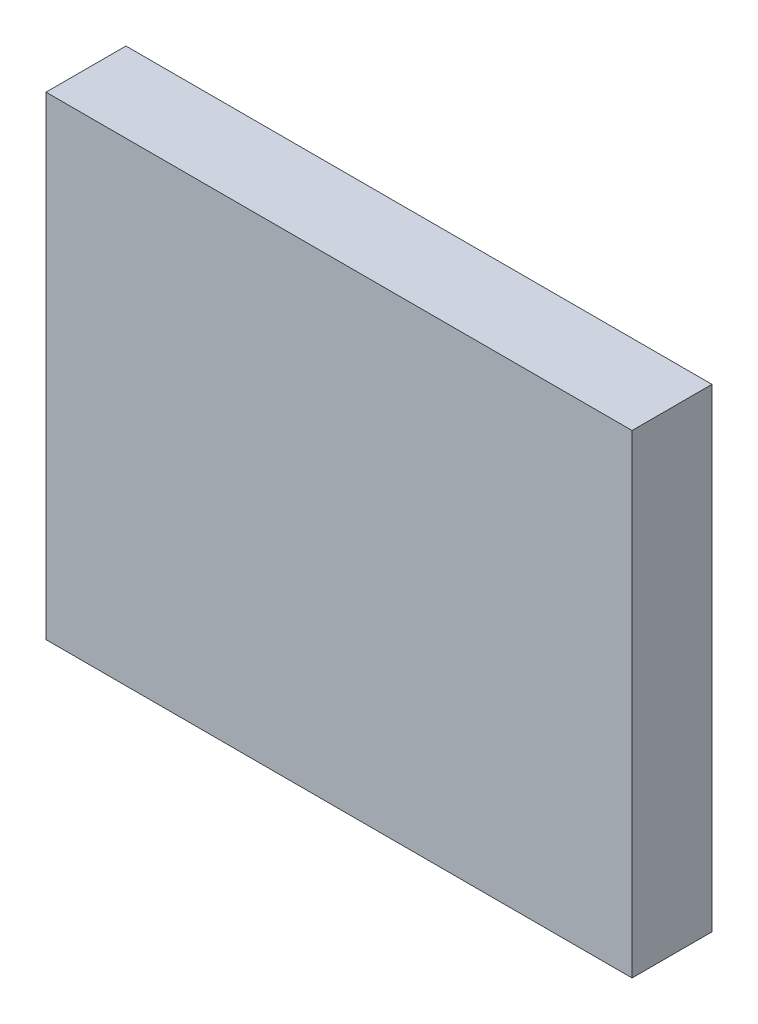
from build123d import *

# Parameters (mm, degrees)
SCHIZZO1_W                   = 110
SCHIZZO1_H                   = 89
ESTRUSIONE_ESTRUSIONE2_DEPTH = 15


with BuildPart() as part:
    # Schizzo1 → Estrusione-Estrusione2 (new body)
    with BuildSketch(Plane.XY):
        with Locations((-55, 44.5)):
            Rectangle(SCHIZZO1_W, SCHIZZO1_H)
    extrude(amount=ESTRUSIONE_ESTRUSIONE2_DEPTH)


solid = part.part
